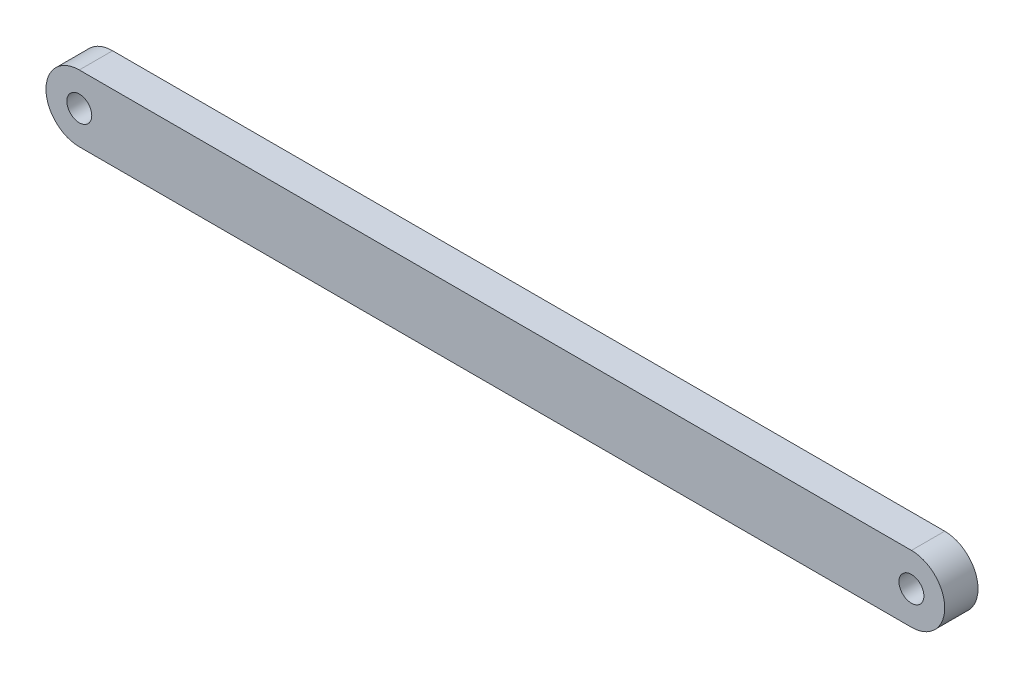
ISO-10303-21;
HEADER;
FILE_DESCRIPTION(('STEP AP214'),'2;1');
FILE_NAME('part.step','',(''),(''),'','','');
FILE_SCHEMA(('AUTOMOTIVE_DESIGN { 1 0 10303 214 1 1 1 1 }'));
ENDSEC;
DATA;
#1=APPLICATION_CONTEXT('core data for automotive mechanical design processes');
#2=APPLICATION_PROTOCOL_DEFINITION('international standard','automotive_design',2000,#1);
#3=PRODUCT_CONTEXT('',#1,'mechanical');
#4=PRODUCT('Part','Part','',(#3));
#5=PRODUCT_RELATED_PRODUCT_CATEGORY('part','',(#4));
#6=PRODUCT_DEFINITION_FORMATION('','',#4);
#7=PRODUCT_DEFINITION_CONTEXT('part definition',#1,'design');
#8=PRODUCT_DEFINITION('design','',#6,#7);
#9=PRODUCT_DEFINITION_SHAPE('','',#8);
#10=(LENGTH_UNIT() NAMED_UNIT(*) SI_UNIT(.MILLI.,.METRE.));
#11=(NAMED_UNIT(*) PLANE_ANGLE_UNIT() SI_UNIT($,.RADIAN.));
#12=(NAMED_UNIT(*) SI_UNIT($,.STERADIAN.) SOLID_ANGLE_UNIT());
#13=UNCERTAINTY_MEASURE_WITH_UNIT(LENGTH_MEASURE(1.E-05),#10,'distance_accuracy_value','');
#14=(GEOMETRIC_REPRESENTATION_CONTEXT(3) GLOBAL_UNCERTAINTY_ASSIGNED_CONTEXT((#13)) GLOBAL_UNIT_ASSIGNED_CONTEXT((#10,
#11,#12)) REPRESENTATION_CONTEXT('',''));
#15=CARTESIAN_POINT('',(0.,0.,0.));
#16=DIRECTION('',(0.,0.,1.));
#17=DIRECTION('',(1.,0.,0.));
#18=AXIS2_PLACEMENT_3D('',#15,#16,#17);
#19=CARTESIAN_POINT('',(-50.,0.,4.));
#20=DIRECTION('',(0.,0.,1.));
#21=DIRECTION('',(1.,0.,0.));
#22=AXIS2_PLACEMENT_3D('',#19,#20,#21);
#23=PLANE('',#22);
#24=CARTESIAN_POINT('',(-50.,0.,4.));
#25=DIRECTION('',(0.,0.,1.));
#26=DIRECTION('',(1.,0.,0.));
#27=AXIS2_PLACEMENT_3D('',#24,#25,#26);
#28=CIRCLE('',#27,1.5);
#29=CARTESIAN_POINT('',(-48.5,0.,4.));
#30=VERTEX_POINT('',#29);
#31=EDGE_CURVE('E102',#30,#30,#28,.T.);
#32=ORIENTED_EDGE('',*,*,#31,.F.);
#33=EDGE_LOOP('',(#32));
#34=FACE_BOUND('',#33,.T.);
#35=CARTESIAN_POINT('',(-50.,0.,4.));
#36=DIRECTION('',(0.,0.,1.));
#37=DIRECTION('',(1.,0.,0.));
#38=AXIS2_PLACEMENT_3D('',#35,#36,#37);
#39=CIRCLE('',#38,4.);
#40=CARTESIAN_POINT('',(-50.,4.,4.));
#41=VERTEX_POINT('',#40);
#42=CARTESIAN_POINT('',(-50.,-4.,4.));
#43=VERTEX_POINT('',#42);
#44=EDGE_CURVE('E87',#41,#43,#39,.T.);
#45=ORIENTED_EDGE('',*,*,#44,.T.);
#46=DIRECTION('',(1.,0.,0.));
#47=VECTOR('',#46,1.);
#48=CARTESIAN_POINT('',(-50.,-4.,4.));
#49=LINE('',#48,#47);
#50=CARTESIAN_POINT('',(50.,-3.99999999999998,4.));
#51=VERTEX_POINT('',#50);
#52=EDGE_CURVE('E82',#43,#51,#49,.T.);
#53=ORIENTED_EDGE('',*,*,#52,.T.);
#54=CARTESIAN_POINT('',(50.,0.,4.));
#55=DIRECTION('',(0.,0.,1.));
#56=DIRECTION('',(1.,0.,0.));
#57=AXIS2_PLACEMENT_3D('',#54,#55,#56);
#58=CIRCLE('',#57,4.);
#59=CARTESIAN_POINT('',(50.,4.00000000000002,4.));
#60=VERTEX_POINT('',#59);
#61=EDGE_CURVE('E85',#51,#60,#58,.T.);
#62=ORIENTED_EDGE('',*,*,#61,.T.);
#63=DIRECTION('',(-1.,0.,0.));
#64=VECTOR('',#63,1.);
#65=CARTESIAN_POINT('',(-50.,4.,4.));
#66=LINE('',#65,#64);
#67=EDGE_CURVE('E52',#60,#41,#66,.T.);
#68=ORIENTED_EDGE('',*,*,#67,.T.);
#69=EDGE_LOOP('',(#45,#53,#62,#68));
#70=FACE_BOUND('',#69,.T.);
#71=CARTESIAN_POINT('',(50.,0.,4.));
#72=DIRECTION('',(0.,0.,1.));
#73=DIRECTION('',(1.,0.,0.));
#74=AXIS2_PLACEMENT_3D('',#71,#72,#73);
#75=CIRCLE('',#74,1.5);
#76=CARTESIAN_POINT('',(51.5,0.,4.));
#77=VERTEX_POINT('',#76);
#78=EDGE_CURVE('E117',#77,#77,#75,.T.);
#79=ORIENTED_EDGE('',*,*,#78,.F.);
#80=EDGE_LOOP('',(#79));
#81=FACE_BOUND('',#80,.T.);
#82=ADVANCED_FACE('F35',(#34,#70,#81),#23,.T.);
#83=CARTESIAN_POINT('',(-50.,0.,0.));
#84=DIRECTION('',(0.,0.,1.));
#85=DIRECTION('',(1.,0.,0.));
#86=AXIS2_PLACEMENT_3D('',#83,#84,#85);
#87=PLANE('',#86);
#88=CARTESIAN_POINT('',(-50.,0.,0.));
#89=DIRECTION('',(0.,0.,1.));
#90=DIRECTION('',(1.,0.,0.));
#91=AXIS2_PLACEMENT_3D('',#88,#89,#90);
#92=CIRCLE('',#91,1.5);
#93=CARTESIAN_POINT('',(-48.5,0.,0.));
#94=VERTEX_POINT('',#93);
#95=EDGE_CURVE('E114',#94,#94,#92,.T.);
#96=ORIENTED_EDGE('',*,*,#95,.T.);
#97=EDGE_LOOP('',(#96));
#98=FACE_BOUND('',#97,.T.);
#99=CARTESIAN_POINT('',(-50.,0.,0.));
#100=DIRECTION('',(0.,0.,1.));
#101=DIRECTION('',(1.,0.,0.));
#102=AXIS2_PLACEMENT_3D('',#99,#100,#101);
#103=CIRCLE('',#102,4.);
#104=CARTESIAN_POINT('',(-50.,4.,0.));
#105=VERTEX_POINT('',#104);
#106=CARTESIAN_POINT('',(-50.,-4.,0.));
#107=VERTEX_POINT('',#106);
#108=EDGE_CURVE('E99',#105,#107,#103,.T.);
#109=ORIENTED_EDGE('',*,*,#108,.F.);
#110=DIRECTION('',(-1.,0.,0.));
#111=VECTOR('',#110,1.);
#112=CARTESIAN_POINT('',(-50.,4.,0.));
#113=LINE('',#112,#111);
#114=CARTESIAN_POINT('',(50.,4.00000000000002,0.));
#115=VERTEX_POINT('',#114);
#116=EDGE_CURVE('E75',#115,#105,#113,.T.);
#117=ORIENTED_EDGE('',*,*,#116,.F.);
#118=CARTESIAN_POINT('',(50.,0.,0.));
#119=DIRECTION('',(0.,0.,1.));
#120=DIRECTION('',(1.,0.,0.));
#121=AXIS2_PLACEMENT_3D('',#118,#119,#120);
#122=CIRCLE('',#121,4.);
#123=CARTESIAN_POINT('',(50.,-3.99999999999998,0.));
#124=VERTEX_POINT('',#123);
#125=EDGE_CURVE('E69',#124,#115,#122,.T.);
#126=ORIENTED_EDGE('',*,*,#125,.F.);
#127=DIRECTION('',(1.,0.,0.));
#128=VECTOR('',#127,1.);
#129=CARTESIAN_POINT('',(-50.,-4.,0.));
#130=LINE('',#129,#128);
#131=EDGE_CURVE('E91',#107,#124,#130,.T.);
#132=ORIENTED_EDGE('',*,*,#131,.F.);
#133=EDGE_LOOP('',(#109,#117,#126,#132));
#134=FACE_BOUND('',#133,.T.);
#135=CARTESIAN_POINT('',(50.,0.,0.));
#136=DIRECTION('',(0.,0.,1.));
#137=DIRECTION('',(1.,0.,0.));
#138=AXIS2_PLACEMENT_3D('',#135,#136,#137);
#139=CIRCLE('',#138,1.5);
#140=CARTESIAN_POINT('',(51.5,0.,0.));
#141=VERTEX_POINT('',#140);
#142=EDGE_CURVE('E120',#141,#141,#139,.T.);
#143=ORIENTED_EDGE('',*,*,#142,.T.);
#144=EDGE_LOOP('',(#143));
#145=FACE_BOUND('',#144,.T.);
#146=ADVANCED_FACE('F110',(#98,#134,#145),#87,.F.);
#147=CARTESIAN_POINT('',(-50.,0.,4.));
#148=DIRECTION('',(0.,0.,-1.));
#149=DIRECTION('',(-1.,0.,0.));
#150=AXIS2_PLACEMENT_3D('',#147,#148,#149);
#151=CYLINDRICAL_SURFACE('',#150,4.);
#152=ORIENTED_EDGE('',*,*,#108,.T.);
#153=DIRECTION('',(0.,0.,-1.));
#154=VECTOR('',#153,1.);
#155=CARTESIAN_POINT('',(-50.,-4.,4.));
#156=LINE('',#155,#154);
#157=EDGE_CURVE('E11',#43,#107,#156,.T.);
#158=ORIENTED_EDGE('',*,*,#157,.F.);
#159=ORIENTED_EDGE('',*,*,#44,.F.);
#160=DIRECTION('',(0.,0.,-1.));
#161=VECTOR('',#160,1.);
#162=CARTESIAN_POINT('',(-50.,4.,4.));
#163=LINE('',#162,#161);
#164=EDGE_CURVE('E95',#41,#105,#163,.T.);
#165=ORIENTED_EDGE('',*,*,#164,.T.);
#166=EDGE_LOOP('',(#152,#158,#159,#165));
#167=FACE_BOUND('',#166,.T.);
#168=ADVANCED_FACE('F37',(#167),#151,.T.);
#169=CARTESIAN_POINT('',(-50.,-4.,4.));
#170=DIRECTION('',(0.,1.,0.));
#171=DIRECTION('',(-1.,0.,0.));
#172=AXIS2_PLACEMENT_3D('',#169,#170,#171);
#173=PLANE('',#172);
#174=ORIENTED_EDGE('',*,*,#131,.T.);
#175=DIRECTION('',(0.,0.,-1.));
#176=VECTOR('',#175,1.);
#177=CARTESIAN_POINT('',(50.,-3.99999999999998,4.));
#178=LINE('',#177,#176);
#179=EDGE_CURVE('E44',#51,#124,#178,.T.);
#180=ORIENTED_EDGE('',*,*,#179,.F.);
#181=ORIENTED_EDGE('',*,*,#52,.F.);
#182=ORIENTED_EDGE('',*,*,#157,.T.);
#183=EDGE_LOOP('',(#174,#180,#181,#182));
#184=FACE_BOUND('',#183,.T.);
#185=ADVANCED_FACE('F90',(#184),#173,.F.);
#186=CARTESIAN_POINT('',(50.,0.,4.));
#187=DIRECTION('',(0.,0.,-1.));
#188=DIRECTION('',(-1.,0.,0.));
#189=AXIS2_PLACEMENT_3D('',#186,#187,#188);
#190=CYLINDRICAL_SURFACE('',#189,4.);
#191=ORIENTED_EDGE('',*,*,#125,.T.);
#192=DIRECTION('',(0.,0.,-1.));
#193=VECTOR('',#192,1.);
#194=CARTESIAN_POINT('',(50.,4.00000000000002,4.));
#195=LINE('',#194,#193);
#196=EDGE_CURVE('E92',#60,#115,#195,.T.);
#197=ORIENTED_EDGE('',*,*,#196,.F.);
#198=ORIENTED_EDGE('',*,*,#61,.F.);
#199=ORIENTED_EDGE('',*,*,#179,.T.);
#200=EDGE_LOOP('',(#191,#197,#198,#199));
#201=FACE_BOUND('',#200,.T.);
#202=ADVANCED_FACE('F93',(#201),#190,.T.);
#203=CARTESIAN_POINT('',(-50.,4.,4.));
#204=DIRECTION('',(0.,-1.,0.));
#205=DIRECTION('',(1.,0.,0.));
#206=AXIS2_PLACEMENT_3D('',#203,#204,#205);
#207=PLANE('',#206);
#208=ORIENTED_EDGE('',*,*,#116,.T.);
#209=ORIENTED_EDGE('',*,*,#164,.F.);
#210=ORIENTED_EDGE('',*,*,#67,.F.);
#211=ORIENTED_EDGE('',*,*,#196,.T.);
#212=EDGE_LOOP('',(#208,#209,#210,#211));
#213=FACE_BOUND('',#212,.T.);
#214=ADVANCED_FACE('F107',(#213),#207,.F.);
#215=CARTESIAN_POINT('',(-50.,0.,4.));
#216=DIRECTION('',(0.,0.,-1.));
#217=DIRECTION('',(-1.,0.,0.));
#218=AXIS2_PLACEMENT_3D('',#215,#216,#217);
#219=CYLINDRICAL_SURFACE('',#218,1.5);
#220=ORIENTED_EDGE('',*,*,#31,.T.);
#221=EDGE_LOOP('',(#220));
#222=FACE_BOUND('',#221,.T.);
#223=ORIENTED_EDGE('',*,*,#95,.F.);
#224=EDGE_LOOP('',(#223));
#225=FACE_BOUND('',#224,.T.);
#226=ADVANCED_FACE('F138',(#222,#225),#219,.F.);
#227=CARTESIAN_POINT('',(50.,0.,4.));
#228=DIRECTION('',(0.,0.,-1.));
#229=DIRECTION('',(-1.,0.,0.));
#230=AXIS2_PLACEMENT_3D('',#227,#228,#229);
#231=CYLINDRICAL_SURFACE('',#230,1.5);
#232=ORIENTED_EDGE('',*,*,#78,.T.);
#233=EDGE_LOOP('',(#232));
#234=FACE_BOUND('',#233,.T.);
#235=ORIENTED_EDGE('',*,*,#142,.F.);
#236=EDGE_LOOP('',(#235));
#237=FACE_BOUND('',#236,.T.);
#238=ADVANCED_FACE('F126',(#234,#237),#231,.F.);
#239=CLOSED_SHELL('',(#82,#146,#168,#185,#202,#214,#226,#238));
#240=MANIFOLD_SOLID_BREP('B2',#239);
#241=ADVANCED_BREP_SHAPE_REPRESENTATION('',(#18,#240),#14);
#242=SHAPE_DEFINITION_REPRESENTATION(#9,#241);
ENDSEC;
END-ISO-10303-21;
